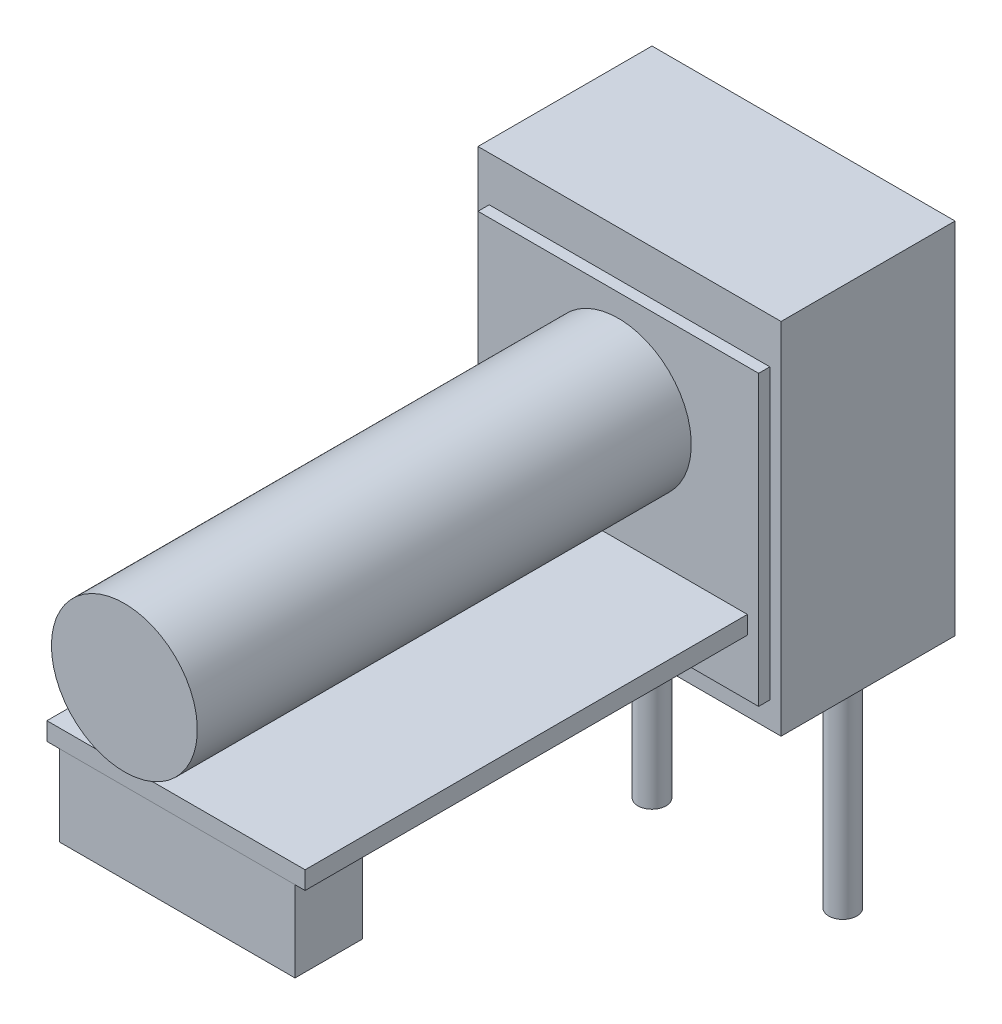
from build123d import *

# Parameters (mm, degrees)
SKETCH1_W          = 27
SKETCH1_H          = 32
EXTRUDE1_DEPTH     = 15.5
SKETCH2_R          = 6.5
EXTRUDE2_DEPTH     = 45
SKETCH3_W          = 25
SKETCH3_H          = 25.7
EXTRUDE3_DEPTH     = 1
SKETCH4_W          = 23
SKETCH4_H          = 1.6
EXTRUDE4_DEPTH     = 39.4
SKETCH5_W          = 21
SKETCH5_H          = 6
EXTRUDE5_DEPTH     = 7.3
CUT_EXTRUDE2_DEPTH = 10
CUT_EXTRUDE3_DEPTH = 2
EXTRUDE6_DEPTH     = 10
SKETCH10_R         = 2.3
EXTRUDE7_DEPTH     = 2
SKETCH11_R         = 3.2
EXTRUDE8_DEPTH     = 1
SKETCH12_R         = 1.25
EXTRUDE9_DEPTH     = 20
SKETCH13_R         = 0.9
CUT_EXTRUDE4_DEPTH = 20


with BuildPart() as part:
    # Sketch1 → Extrude1 (new body)
    with BuildSketch(Plane.XY):
        with Locations((41.782822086, 19.571063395)):
            Rectangle(SKETCH1_W, SKETCH1_H)
    extrude(amount=EXTRUDE1_DEPTH)

    # Sketch2 → Extrude2 (add)
    with BuildSketch(Plane.XY.offset(15.5)):
        with Locations(Location((41.782822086, 23.071063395, 0), (0, 0, 180))):
            Circle(SKETCH2_R)
    extrude(amount=EXTRUDE2_DEPTH)

    # Sketch3 → Extrude3 (add)
    with BuildSketch(Plane.XY.offset(15.5)):
        with Locations((41.782822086, 18.721063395)):
            Rectangle(SKETCH3_W, SKETCH3_H)
    extrude(amount=EXTRUDE3_DEPTH)

    # Sketch4 → Extrude4 (add)
    with BuildSketch(Plane.XY.offset(16.5)):
        with Locations((41.782822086, 11.671063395)):
            Rectangle(SKETCH4_W, SKETCH4_H)
    extrude(amount=EXTRUDE4_DEPTH)

    # Sketch5 → Extrude5 (add)
    with BuildSketch(Plane.XZ.offset(-10.871063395)):
        with Locations((41.782822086, 52.8)):
            Rectangle(SKETCH5_W, SKETCH5_H)
    extrude(amount=EXTRUDE5_DEPTH)

    # Sketch7 → Cut-Extrude2 (cut)
    with BuildSketch(Plane(origin=(0, 0, 0), x_dir=(-1, 0, 0), z_dir=(0, 0, -1))):
        with BuildLine():
            Line((-52.282822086, 16.761588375), (-52.282822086, 4.586233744))
            Line((-52.282822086, 4.586233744), (-31.282822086, 4.586233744))
            Line((-31.282822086, 4.586233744), (-31.282822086, 16.761588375))
            ThreePointArc((-31.282822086, 16.761588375), (-41.782822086, 34.571063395), (-52.282822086, 16.761588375))
        make_face()
    extrude(amount=-CUT_EXTRUDE2_DEPTH, mode=Mode.SUBTRACT)

    # Sketch8 → Cut-Extrude3 (cut)
    with BuildSketch(Plane.XZ.offset(-3.571063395)):
        with BuildLine():
            Line((35.282822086, 0), (31.282822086, 0))
            Line((31.282822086, 0), (31.282822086, 3.864218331))
            ThreePointArc((31.282822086, 3.864218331), (30.982822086, 5), (31.282822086, 6.135781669))
            Line((31.282822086, 6.135781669), (31.282822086, 8))
            ThreePointArc((31.282822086, 8), (33.282822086, 10), (35.282822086, 8))
            Line((35.282822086, 8), (35.282822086, 6.135781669))
            ThreePointArc((35.282822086, 6.135781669), (35.582822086, 5), (35.282822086, 3.864218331))
            Line((35.282822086, 3.864218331), (35.282822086, 0))
        make_face()
        with BuildLine():
            Line((52.282822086, 0), (48.282822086, 0))
            Line((48.282822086, 0), (48.282822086, 3.864218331))
            ThreePointArc((48.282822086, 3.864218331), (47.982822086, 5), (48.282822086, 6.135781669))
            Line((48.282822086, 6.135781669), (48.282822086, 8))
            ThreePointArc((48.282822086, 8), (50.282822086, 10), (52.282822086, 8))
            Line((52.282822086, 8), (52.282822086, 6.135781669))
            ThreePointArc((52.282822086, 6.135781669), (52.582822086, 5), (52.282822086, 3.864218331))
            Line((52.282822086, 3.864218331), (52.282822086, 0))
        make_face()
    extrude(amount=-CUT_EXTRUDE3_DEPTH, mode=Mode.SUBTRACT)

    # Sketch9 → Extrude6 (add)
    with BuildSketch(Plane(origin=(0, 0, 10), x_dir=(-1, 0, 0), z_dir=(0, 0, -1))):
        Polygon((-33.690543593, 28.251443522), (-42.656036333, 32.419372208), (-50.748314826, 26.73899208), (-49.875100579, 16.890683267), (-40.909607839, 12.722754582), (-32.817329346, 18.403134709), align=None)
    extrude(amount=EXTRUDE6_DEPTH)

    # Sketch10 → Extrude7 (add)
    with BuildSketch(Plane.XZ.offset(-3.571063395)):
        with Locations((33.282822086, 5)):
            Circle(SKETCH10_R)
        with Locations((50.282822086, 5)):
            Circle(SKETCH10_R)
    extrude(amount=-EXTRUDE7_DEPTH)

    # Sketch11 → Extrude8 (add)
    with BuildSketch(Plane.XZ.offset(-3.571063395)):
        with Locations(Location((33.282822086, 5, 0), (0, 0, 51.317812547))):
            Circle(SKETCH11_R)
        with Locations(Location((50.282822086, 5, 0), (0, 0, 51.317812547))):
            Circle(SKETCH11_R)
    extrude(amount=EXTRUDE8_DEPTH)

    # Sketch12 → Extrude9 (add)
    with BuildSketch(Plane.XZ.offset(-2.571063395)):
        with Locations(Location((33.282822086, 5, 0), (0, 0, 270))):
            Circle(SKETCH12_R)
        with Locations(Location((50.282822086, 5, 0), (0, 0, 270))):
            Circle(SKETCH12_R)
    extrude(amount=EXTRUDE9_DEPTH)

    # Sketch13 → Cut-Extrude4 (cut)
    with BuildSketch(Plane.XZ.offset(17.428936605)):
        with Locations(Location((33.282822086, 5, 0), (0, 0, 270))):
            Circle(SKETCH13_R)
        with Locations(Location((50.282822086, 5, 0), (0, 0, 270))):
            Circle(SKETCH13_R)
    extrude(amount=-CUT_EXTRUDE4_DEPTH, mode=Mode.SUBTRACT)


solid = part.part
